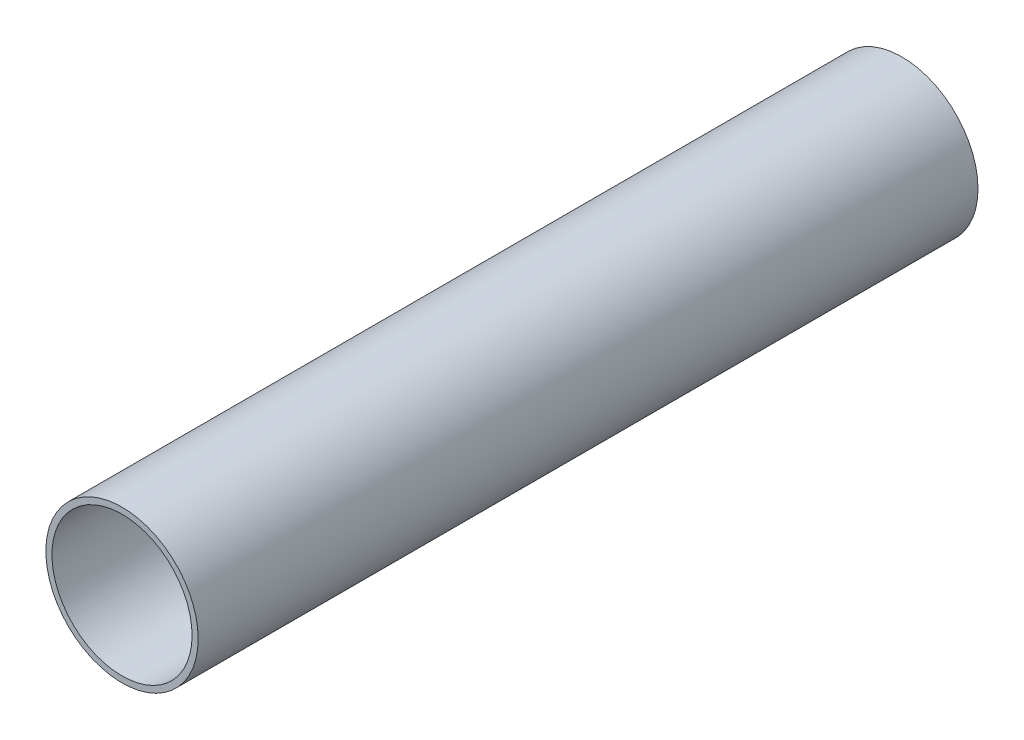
from build123d import *

# Parameters (mm, degrees)
EXTRUDE1_DEPTH      = 128
EXTRUDE1_DEPTH_BACK = 128
SKETCH1_R           = 25
SKETCH1_R_2         = 23


with BuildPart() as part:
    # Sketch1 → Extrude1 (new, two sides: drawn at the far end of the back side and taken through both)
    with BuildSketch(Plane.XY.offset(-EXTRUDE1_DEPTH_BACK)):
        Circle(SKETCH1_R)
        Circle(SKETCH1_R_2, mode=Mode.SUBTRACT)
    extrude(amount=EXTRUDE1_DEPTH + EXTRUDE1_DEPTH_BACK)


solid = part.part
